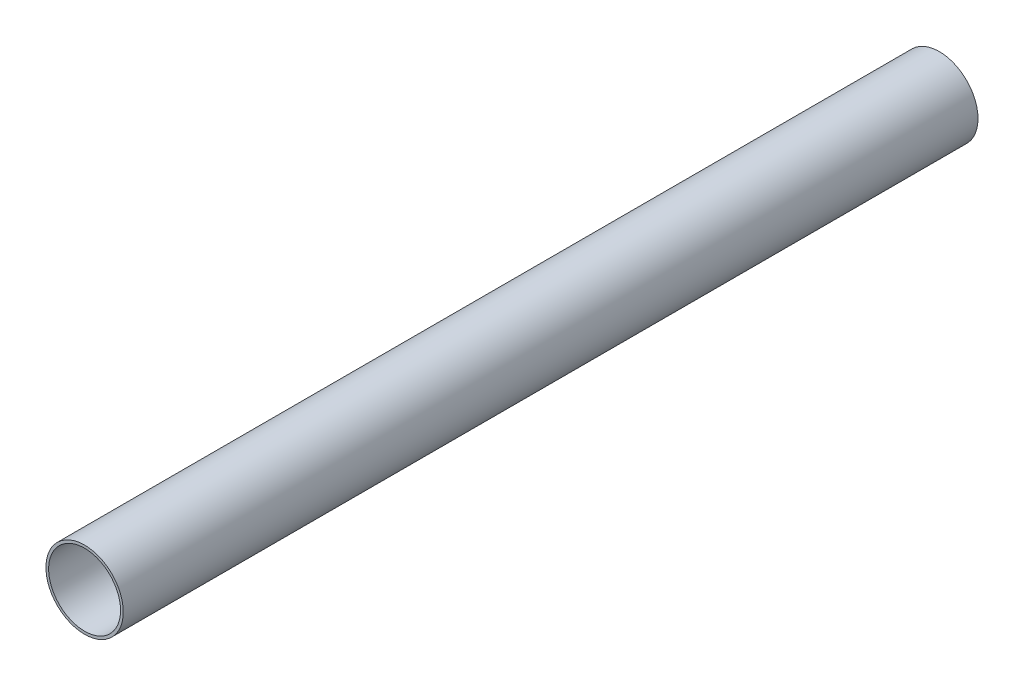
ISO-10303-21;
HEADER;
FILE_DESCRIPTION(('STEP AP214'),'2;1');
FILE_NAME('part.step','',(''),(''),'','','');
FILE_SCHEMA(('AUTOMOTIVE_DESIGN { 1 0 10303 214 1 1 1 1 }'));
ENDSEC;
DATA;
#1=APPLICATION_CONTEXT('core data for automotive mechanical design processes');
#2=APPLICATION_PROTOCOL_DEFINITION('international standard','automotive_design',2000,#1);
#3=PRODUCT_CONTEXT('',#1,'mechanical');
#4=PRODUCT('Part','Part','',(#3));
#5=PRODUCT_RELATED_PRODUCT_CATEGORY('part','',(#4));
#6=PRODUCT_DEFINITION_FORMATION('','',#4);
#7=PRODUCT_DEFINITION_CONTEXT('part definition',#1,'design');
#8=PRODUCT_DEFINITION('design','',#6,#7);
#9=PRODUCT_DEFINITION_SHAPE('','',#8);
#10=(LENGTH_UNIT() NAMED_UNIT(*) SI_UNIT(.MILLI.,.METRE.));
#11=(NAMED_UNIT(*) PLANE_ANGLE_UNIT() SI_UNIT($,.RADIAN.));
#12=(NAMED_UNIT(*) SI_UNIT($,.STERADIAN.) SOLID_ANGLE_UNIT());
#13=UNCERTAINTY_MEASURE_WITH_UNIT(LENGTH_MEASURE(1.E-05),#10,'distance_accuracy_value','');
#14=(GEOMETRIC_REPRESENTATION_CONTEXT(3) GLOBAL_UNCERTAINTY_ASSIGNED_CONTEXT((#13)) GLOBAL_UNIT_ASSIGNED_CONTEXT((#10,
#11,#12)) REPRESENTATION_CONTEXT('',''));
#15=CARTESIAN_POINT('',(0.,0.,0.));
#16=DIRECTION('',(0.,0.,1.));
#17=DIRECTION('',(1.,0.,0.));
#18=AXIS2_PLACEMENT_3D('',#15,#16,#17);
#19=CARTESIAN_POINT('',(0.,0.,642.9375));
#20=DIRECTION('',(0.,0.,1.));
#21=DIRECTION('',(1.,0.,0.));
#22=AXIS2_PLACEMENT_3D('',#19,#20,#21);
#23=PLANE('',#22);
#24=CARTESIAN_POINT('',(0.,0.,642.9375));
#25=DIRECTION('',(0.,0.,1.));
#26=DIRECTION('',(1.,0.,0.));
#27=AXIS2_PLACEMENT_3D('',#24,#25,#26);
#28=CIRCLE('',#27,29.083);
#29=CARTESIAN_POINT('',(29.083,0.,642.9375));
#30=VERTEX_POINT('',#29);
#31=EDGE_CURVE('E10',#30,#30,#28,.T.);
#32=ORIENTED_EDGE('',*,*,#31,.T.);
#33=EDGE_LOOP('',(#32));
#34=FACE_BOUND('',#33,.T.);
#35=CARTESIAN_POINT('',(0.,0.,642.9375));
#36=DIRECTION('',(0.,0.,1.));
#37=DIRECTION('',(1.,0.,0.));
#38=AXIS2_PLACEMENT_3D('',#35,#36,#37);
#39=CIRCLE('',#38,27.051);
#40=CARTESIAN_POINT('',(27.051,0.,642.9375));
#41=VERTEX_POINT('',#40);
#42=EDGE_CURVE('E40',#41,#41,#39,.T.);
#43=ORIENTED_EDGE('',*,*,#42,.F.);
#44=EDGE_LOOP('',(#43));
#45=FACE_BOUND('',#44,.T.);
#46=ADVANCED_FACE('F29',(#34,#45),#23,.T.);
#47=CARTESIAN_POINT('',(0.,0.,0.));
#48=DIRECTION('',(0.,0.,1.));
#49=DIRECTION('',(1.,0.,0.));
#50=AXIS2_PLACEMENT_3D('',#47,#48,#49);
#51=PLANE('',#50);
#52=CARTESIAN_POINT('',(0.,0.,0.));
#53=DIRECTION('',(0.,0.,1.));
#54=DIRECTION('',(1.,0.,0.));
#55=AXIS2_PLACEMENT_3D('',#52,#53,#54);
#56=CIRCLE('',#55,29.083);
#57=CARTESIAN_POINT('',(29.083,0.,0.));
#58=VERTEX_POINT('',#57);
#59=EDGE_CURVE('E36',#58,#58,#56,.T.);
#60=ORIENTED_EDGE('',*,*,#59,.F.);
#61=EDGE_LOOP('',(#60));
#62=FACE_BOUND('',#61,.T.);
#63=CARTESIAN_POINT('',(0.,0.,0.));
#64=DIRECTION('',(0.,0.,1.));
#65=DIRECTION('',(1.,0.,0.));
#66=AXIS2_PLACEMENT_3D('',#63,#64,#65);
#67=CIRCLE('',#66,27.051);
#68=CARTESIAN_POINT('',(27.051,0.,0.));
#69=VERTEX_POINT('',#68);
#70=EDGE_CURVE('E44',#69,#69,#67,.T.);
#71=ORIENTED_EDGE('',*,*,#70,.T.);
#72=EDGE_LOOP('',(#71));
#73=FACE_BOUND('',#72,.T.);
#74=ADVANCED_FACE('F50',(#62,#73),#51,.F.);
#75=CARTESIAN_POINT('',(0.,0.,642.9375));
#76=DIRECTION('',(0.,0.,-1.));
#77=DIRECTION('',(-1.,0.,0.));
#78=AXIS2_PLACEMENT_3D('',#75,#76,#77);
#79=CYLINDRICAL_SURFACE('',#78,29.083);
#80=ORIENTED_EDGE('',*,*,#31,.F.);
#81=EDGE_LOOP('',(#80));
#82=FACE_BOUND('',#81,.T.);
#83=ORIENTED_EDGE('',*,*,#59,.T.);
#84=EDGE_LOOP('',(#83));
#85=FACE_BOUND('',#84,.T.);
#86=ADVANCED_FACE('F31',(#82,#85),#79,.T.);
#87=CARTESIAN_POINT('',(0.,0.,642.9375));
#88=DIRECTION('',(0.,0.,-1.));
#89=DIRECTION('',(-1.,0.,0.));
#90=AXIS2_PLACEMENT_3D('',#87,#88,#89);
#91=CYLINDRICAL_SURFACE('',#90,27.051);
#92=ORIENTED_EDGE('',*,*,#42,.T.);
#93=EDGE_LOOP('',(#92));
#94=FACE_BOUND('',#93,.T.);
#95=ORIENTED_EDGE('',*,*,#70,.F.);
#96=EDGE_LOOP('',(#95));
#97=FACE_BOUND('',#96,.T.);
#98=ADVANCED_FACE('F52',(#94,#97),#91,.F.);
#99=CLOSED_SHELL('',(#46,#74,#86,#98));
#100=MANIFOLD_SOLID_BREP('B2',#99);
#101=ADVANCED_BREP_SHAPE_REPRESENTATION('',(#18,#100),#14);
#102=SHAPE_DEFINITION_REPRESENTATION(#9,#101);
ENDSEC;
END-ISO-10303-21;
